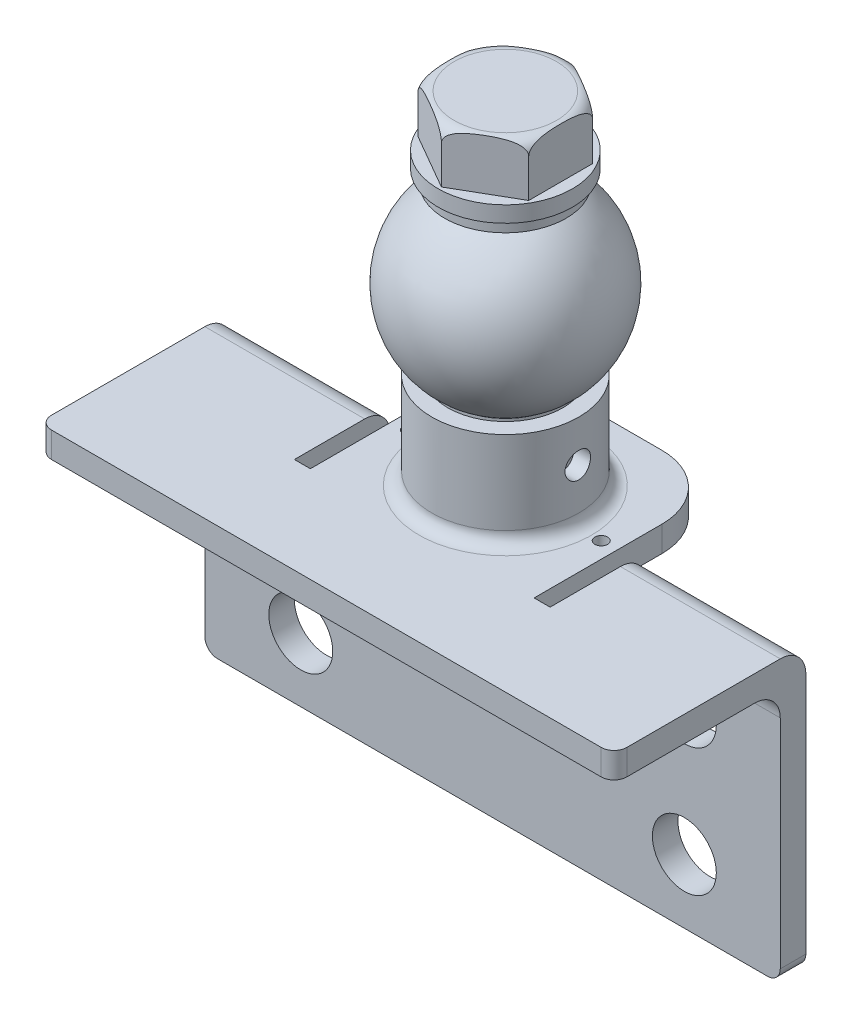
from build123d import *

# Parameters (mm, degrees)
BOSS_EXTRUDE1_DEPTH = 45
SKETCH2_R           = 5
CUT_EXTRUDE1_DEPTH  = 40
SKETCH3_W           = 40
SKETCH3_H           = 26
CUT_EXTRUDE2_DEPTH  = 23
SKETCH4_W           = 35
SKETCH4_H           = 4
BOSS_EXTRUDE2_DEPTH = 30
FILLET1_R           = 10
SKETCH5_R           = 9
SKETCH5_R_2         = 1
CUT_EXTRUDE3_DEPTH  = 10
BOSS_EXTRUDE3_START = 15
SKETCH6_R           = 11.5
SKETCH6_R_2         = 9
BOSS_EXTRUDE3_DEPTH = 15
FILLET2_R           = 2
FILLET3_R           = 2
SKETCH7_R           = 2
CUT_EXTRUDE4_DEPTH  = 40
SKETCH9_R           = 2
CUT_EXTRUDE5_DEPTH  = 28
SKETCH10_R          = 7.5
CUT_EXTRUDE6_DEPTH  = 32.5
SKETCH12_OUTSIDE_W  = 120.01
SKETCH12_OUTSIDE_H  = 75.01
CUT_EXTRUDE8_DEPTH  = 10.5
BOSS_EXTRUDE4_DEPTH = 2.5
SKETCH14_R          = 9.5
SKETCH14_R_2        = 7.25
BOSS_EXTRUDE5_DEPTH = 2


with BuildPart() as part:
    # Sketch1 → Boss-Extrude1 (new, symmetric)
    with BuildSketch(Plane(origin=(0, 0, 0), x_dir=(0, 0, -1), z_dir=(1, 0, 0))):
        with BuildLine():
            Line((-2, 0), (-2, 36))
            ThreePointArc((-2, 36), (-3.171572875, 38.828427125), (-6, 40))
            Line((-6, 40), (-28, 40))
            Line((-28, 40), (-28, 44))
            Line((-28, 44), (-2, 44))
            ThreePointArc((-2, 44), (0.828427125, 42.828427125), (2, 40))
            Line((2, 40), (2, 0))
            Line((2, 0), (-2, 0))
        make_face()
    extrude(amount=BOSS_EXTRUDE1_DEPTH, both=True)

    # Sketch2 → Cut-Extrude1 (cut)
    with BuildSketch(Plane(origin=(0, 0, -2), x_dir=(-1, 0, 0), z_dir=(0, 0, -1))):
        with Locations((-30, 30)):
            Circle(SKETCH2_R)
        with Locations((-30, 10)):
            Circle(SKETCH2_R)
        with Locations((30, 10)):
            Circle(SKETCH2_R)
        with Locations((30, 30)):
            Circle(SKETCH2_R)
    extrude(amount=-CUT_EXTRUDE1_DEPTH, mode=Mode.SUBTRACT)

    # Sketch3 → Cut-Extrude2 (cut)
    with BuildSketch(Plane(origin=(0, 44, 0), x_dir=(1, 0, 0), z_dir=(0, 1, 0))):
        Rectangle(SKETCH3_W, SKETCH3_H)
    extrude(amount=-CUT_EXTRUDE2_DEPTH, mode=Mode.SUBTRACT)

    # Sketch4 → Boss-Extrude2 (add)
    with BuildSketch(Plane(origin=(0, 0, 13), x_dir=(-1, 0, 0), z_dir=(0, 0, -1))):
        with Locations((0, 42)):
            Rectangle(SKETCH4_W, SKETCH4_H)
    extrude(amount=BOSS_EXTRUDE2_DEPTH)

    # Fillet1
    fillet1_edges = [part.edges().sort_by_distance(p)[0] for p in [
        (-17.5, 42, -17),
        (17.5, 42, -17),
    ]]
    fillet(fillet1_edges, radius=FILLET1_R)

    # Sketch5 → Cut-Extrude3 (cut)
    with BuildSketch(Plane(origin=(0, 44, 0), x_dir=(1, 0, 0), z_dir=(0, 1, 0))):
        with Locations(Location((0, 0, 0), (0, 0, 270))):
            Circle(SKETCH5_R)
        with Locations(Location((-15, 0, 0), (0, 0, 270))):
            Circle(SKETCH5_R_2)
        with Locations(Location((15, 0, 0), (0, 0, 270))):
            Circle(SKETCH5_R_2)
    extrude(amount=-CUT_EXTRUDE3_DEPTH, mode=Mode.SUBTRACT)

    # Sketch6 → Boss-Extrude3 (add)
    with BuildSketch(Plane(origin=(0, 44, 0), x_dir=(1, 0, 0), z_dir=(0, 1, 0)).offset(BOSS_EXTRUDE3_START)):
        with Locations(Location((0, 0, 0), (0, 0, 90))):
            Circle(SKETCH6_R)
        with Locations(Location((0, 0, 0), (0, 0, 270))):
            Circle(SKETCH6_R_2, mode=Mode.SUBTRACT)
    extrude(amount=-BOSS_EXTRUDE3_DEPTH)

    # Fillet2
    fillet2_edges = [part.edges().sort_by_distance(p)[0] for p in [
        (0, 44, 11.5),
    ]]
    fillet(fillet2_edges, radius=FILLET2_R)

    # Fillet3
    fillet3_edges = [part.edges().sort_by_distance(p)[0] for p in [
        (-45, 42, 28),
        (45, 0, 0),
        (45, 42, 28),
        (-45, 0, 0),
    ]]
    fillet(fillet3_edges, radius=FILLET3_R)

    # Sketch7 → Cut-Extrude4 (cut, symmetric)
    with BuildSketch(Plane(origin=(0, 0, 0), x_dir=(0, 0, -1), z_dir=(1, 0, 0))):
        with Locations((0, 52.5)):
            Circle(SKETCH7_R)
    extrude(amount=CUT_EXTRUDE4_DEPTH, both=True, mode=Mode.SUBTRACT)


with BuildPart() as body_2:
    # Sketch8 → Revolve1 (revolve)
    with BuildSketch(Plane(origin=(0, 0, 0), x_dir=(0, 0, -1), z_dir=(1, 0, 0)), mode=Mode.PRIVATE) as revolve1_sk:
        with BuildLine():
            Line((-8.4, 40), (-8.4, 59))
            ThreePointArc((-8.4, 59), (-14.342434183, 75.819948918), (0, 86.427389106))
            Line((0, 86.427389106), (0, 40))
            Line((0, 40), (-8.4, 40))
        make_face()
    revolve(revolve1_sk.sketch.rotate(Axis((0, 40, 0), (0, 1, 0)), 180), axis=Axis((0, 40, 0), (0, 1, 0)))

    # Sketch9 → Cut-Extrude5 (cut, symmetric)
    with BuildSketch(Plane(origin=(0, 0, 0), x_dir=(0, 0, -1), z_dir=(1, 0, 0))):
        with Locations((0, 52.5)):
            Circle(SKETCH9_R)
    extrude(amount=CUT_EXTRUDE5_DEPTH, both=True, mode=Mode.SUBTRACT)

    # Sketch10 → Cut-Extrude6 (cut)
    with BuildSketch(Plane(origin=(0, 71, 0), x_dir=(1, 0, 0), z_dir=(0, 1, 0))):
        with Locations(Location((0, 0, 0), (0, 0, 270))):
            Circle(SKETCH10_R)
    extrude(amount=CUT_EXTRUDE6_DEPTH, mode=Mode.SUBTRACT)


with BuildPart() as body_3:
    # Sketch11 → Revolve2 (revolve)
    with BuildSketch(Plane.XY, mode=Mode.PRIVATE) as revolve2_sk:
        with BuildLine():
            Line((-7, 71), (-7, 89.417770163))
            Line((-7, 89.417770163), (-10, 89.417770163))
            Line((-10, 89.417770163), (-10, 95.417770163))
            ThreePointArc((-10, 95.417770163), (-9.414213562, 96.831983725), (-8, 97.417770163))
            Line((-8, 97.417770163), (0, 97.417770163))
            Line((0, 97.417770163), (0, 71))
            Line((0, 71), (-7, 71))
        make_face()
    revolve(revolve2_sk.sketch.rotate(Axis((0, 71, 0), (0, 1, 0)), 270), axis=Axis((0, 71, 0), (0, 1, 0)))

    # Sketch12 outside → Cut-Extrude8 (cut)
    with BuildSketch(Plane(origin=(0, 97.417770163, 0), x_dir=(1, 0, 0), z_dir=(0, 1, 0))):
        with Locations((0, -5.5)):
            Rectangle(SKETCH12_OUTSIDE_W, SKETCH12_OUTSIDE_H)
        Polygon((0, 10), (8.660254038, 5), (8.660254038, -5), (0, -10), (-8.660254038, -5), (-8.660254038, 5), align=None, mode=Mode.SUBTRACT)
    extrude(amount=-CUT_EXTRUDE8_DEPTH, mode=Mode.SUBTRACT)


with BuildPart() as body_4:
    # Sketch13 → Boss-Extrude4 (new body)
    with BuildSketch(Plane.XZ.offset(-89.417770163)):
        with BuildLine():
            Line((1.597864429, -7.07172746), (2.314148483, -10.241812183))
            ThreePointArc((2.314148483, -10.241812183), (-2.956400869, 10.075201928), (3.586847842, -9.868359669))
            Line((3.586847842, -9.868359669), (2.476633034, -6.813867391))
            ThreePointArc((2.476633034, -6.813867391), (-2.04132441, 6.956687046), (1.597864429, -7.07172746))
        make_face()
    extrude(amount=BOSS_EXTRUDE4_DEPTH)


with BuildPart() as body_5:
    # Sketch14 → Boss-Extrude5 (new body)
    with BuildSketch(Plane.XZ.offset(-86.917770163)):
        with Locations(Location((0, 0, 0), (0, 0, 270))):
            Circle(SKETCH14_R)
        with Locations(Location((0, 0, 0), (0, 0, 270))):
            Circle(SKETCH14_R_2, mode=Mode.SUBTRACT)
    extrude(amount=BOSS_EXTRUDE5_DEPTH)


solid = Compound([part.part, body_2.part, body_3.part, body_4.part, body_5.part])
